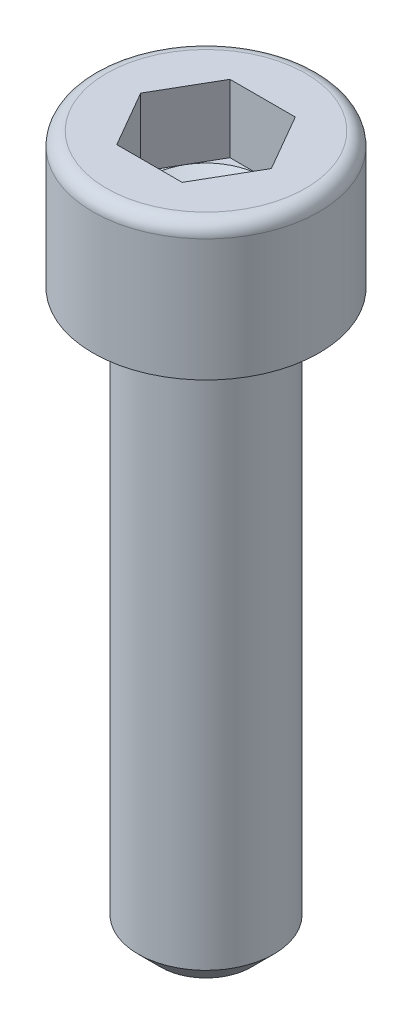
from build123d import *

# Parameters (mm, degrees)
TIGE_START              = -25
ESQUISSE1_R             = 3
TIGE_DEPTH              = 25
CHANFREIN_D_ENTR_E_SIZE = 1
HEXAGONE_DEPTH          = 3


with BuildPart() as part:
    # Esquisse1 → Tige (new body)
    with BuildSketch(Plane(origin=(0, 0, 0), x_dir=(1, 0, 0), z_dir=(0, 1, 0)).offset(TIGE_START)):
        with Locations(Location((0, 0, 0), (0, 0, 270))):
            Circle(ESQUISSE1_R)
    extrude(amount=TIGE_DEPTH)

    # Chanfrein d_entr_e
    chanfrein_d_entr_e_edges = [part.edges().sort_by_distance(p)[0] for p in [
        (0, -25, -3),
    ]]
    chamfer(chanfrein_d_entr_e_edges, length=CHANFREIN_D_ENTR_E_SIZE)

    # Esquisse2 → T_te (revolve)
    with BuildSketch(Plane.XY, mode=Mode.PRIVATE) as t_te_sk:
        with BuildLine():
            Line((2.5, 6), (2.5, 3))
            Line((2.5, 3), (0, 1.556624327))
            Line((0, 1.556624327), (0, 0))
            Line((0, 0), (5, 0))
            Line((5, 0), (5, 5.4))
            ThreePointArc((5, 5.4), (4.824264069, 5.824264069), (4.4, 6))
            Line((4.4, 6), (2.5, 6))
        make_face()
    revolve(t_te_sk.sketch.rotate(Axis((0, 6, 0), (0, -1, 0)), 180), axis=Axis((0, 6, 0), (0, -1, 0)))

    # Esquisse3 → Hexagone (cut)
    with BuildSketch(Plane(origin=(0, 6, -3), x_dir=(1, 0, 0), z_dir=(0, -1, 0))):
        Polygon((1.443375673, 5.5), (-1.443375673, 5.5), (-2.886751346, 3), (-1.443375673, 0.5), (1.443375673, 0.5), (2.886751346, 3), align=None)
    extrude(amount=HEXAGONE_DEPTH, mode=Mode.SUBTRACT)


solid = part.part
